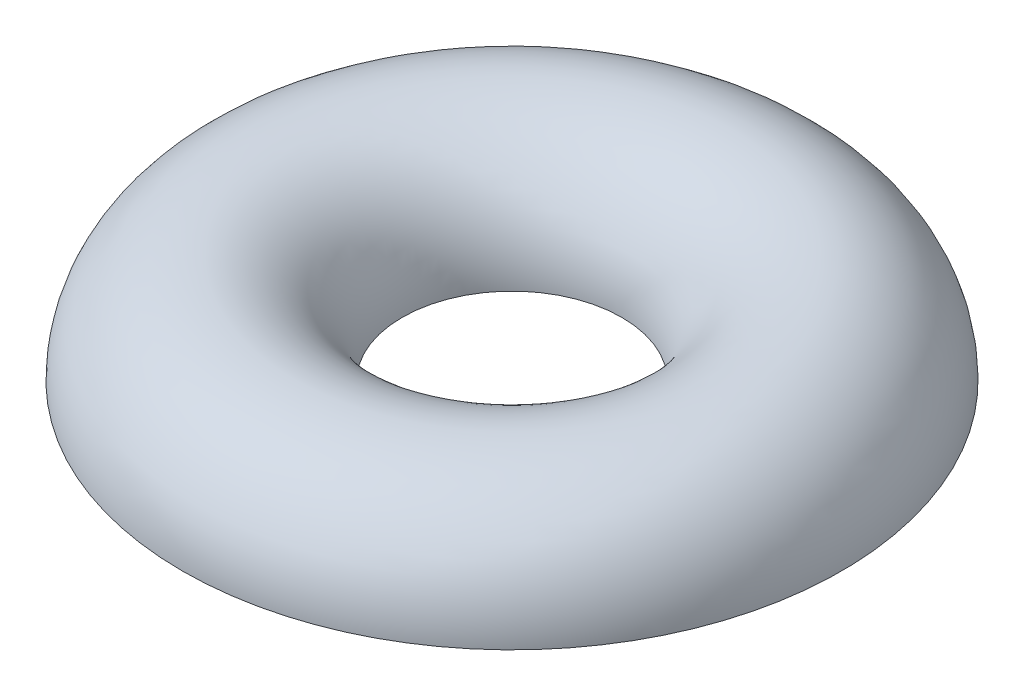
from build123d import *

# Parameters (mm, degrees)
SKETCH1_R               = 25.4
CUT_EXTRUDE1_DEPTH      = 111.716033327
CUT_EXTRUDE1_DEPTH_BACK = 111.716033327
SKETCH2_W               = 159.238420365
SKETCH2_H               = 33.394571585


with BuildPart() as part:
    # Sketch1 → Base-Revolve (revolve)
    with BuildSketch(Plane.XY, mode=Mode.PRIVATE) as base_revolve_sk:
        with Locations((50.8, 0)):
            Circle(SKETCH1_R)
    revolve(base_revolve_sk.sketch.rotate(Axis((0, 70.114951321, 0), (0, -1, 0)), 90), axis=Axis((0, 70.114951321, 0), (0, -1, 0)))

    # Sketch2 → Cut-Extrude1 (cut, two sides: drawn at the far end of the back side and taken through both)
    with BuildSketch(Plane.XY.offset(-CUT_EXTRUDE1_DEPTH_BACK)):
        with Locations((-0.363973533, -16.697285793)):
            Rectangle(SKETCH2_W, SKETCH2_H)
    extrude(amount=CUT_EXTRUDE1_DEPTH + CUT_EXTRUDE1_DEPTH_BACK, mode=Mode.SUBTRACT)


solid = part.part
